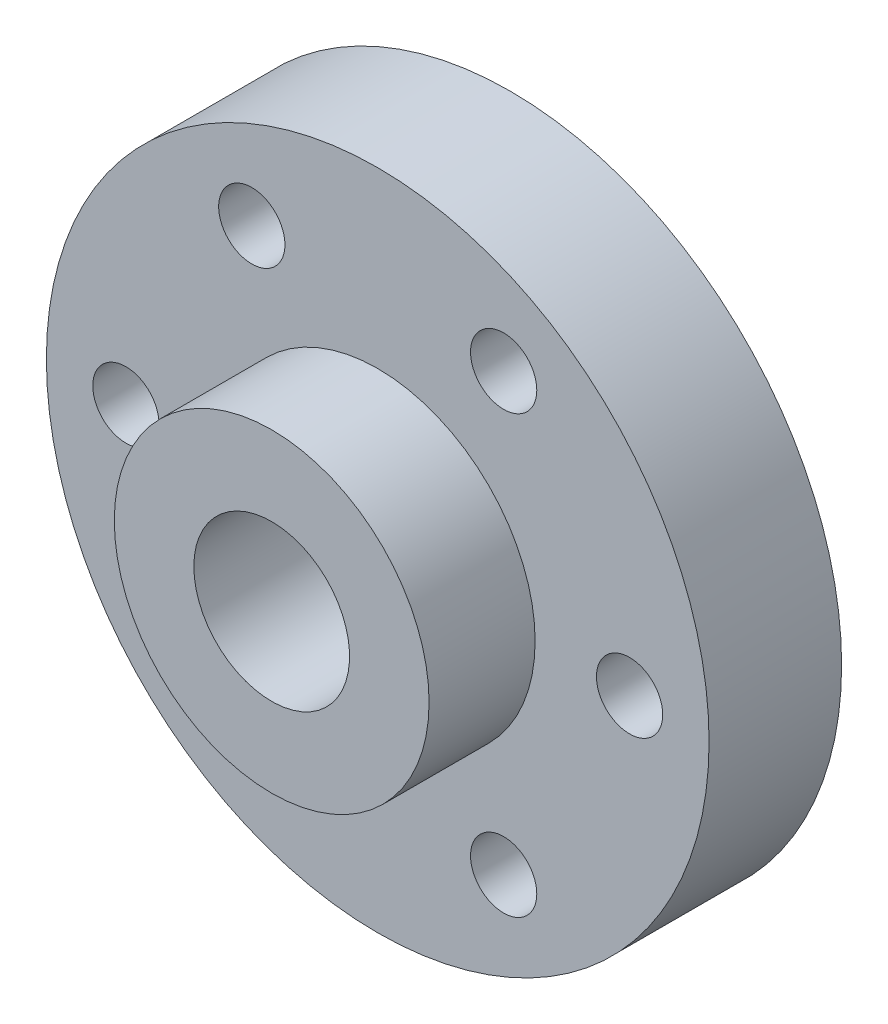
ISO-10303-21;
HEADER;
FILE_DESCRIPTION(('STEP AP214'),'2;1');
FILE_NAME('part.step','',(''),(''),'','','');
FILE_SCHEMA(('AUTOMOTIVE_DESIGN { 1 0 10303 214 1 1 1 1 }'));
ENDSEC;
DATA;
#1=APPLICATION_CONTEXT('core data for automotive mechanical design processes');
#2=APPLICATION_PROTOCOL_DEFINITION('international standard','automotive_design',2000,#1);
#3=PRODUCT_CONTEXT('',#1,'mechanical');
#4=PRODUCT('Part','Part','',(#3));
#5=PRODUCT_RELATED_PRODUCT_CATEGORY('part','',(#4));
#6=PRODUCT_DEFINITION_FORMATION('','',#4);
#7=PRODUCT_DEFINITION_CONTEXT('part definition',#1,'design');
#8=PRODUCT_DEFINITION('design','',#6,#7);
#9=PRODUCT_DEFINITION_SHAPE('','',#8);
#10=(LENGTH_UNIT() NAMED_UNIT(*) SI_UNIT(.MILLI.,.METRE.));
#11=(NAMED_UNIT(*) PLANE_ANGLE_UNIT() SI_UNIT($,.RADIAN.));
#12=(NAMED_UNIT(*) SI_UNIT($,.STERADIAN.) SOLID_ANGLE_UNIT());
#13=UNCERTAINTY_MEASURE_WITH_UNIT(LENGTH_MEASURE(1.E-05),#10,'distance_accuracy_value','');
#14=(GEOMETRIC_REPRESENTATION_CONTEXT(3) GLOBAL_UNCERTAINTY_ASSIGNED_CONTEXT((#13)) GLOBAL_UNIT_ASSIGNED_CONTEXT((#10,
#11,#12)) REPRESENTATION_CONTEXT('',''));
#15=CARTESIAN_POINT('',(0.,0.,0.));
#16=DIRECTION('',(0.,0.,1.));
#17=DIRECTION('',(1.,0.,0.));
#18=AXIS2_PLACEMENT_3D('',#15,#16,#17);
#19=CARTESIAN_POINT('',(0.,0.,5.08));
#20=DIRECTION('',(0.,0.,1.));
#21=DIRECTION('',(1.,0.,0.));
#22=AXIS2_PLACEMENT_3D('',#19,#20,#21);
#23=PLANE('',#22);
#24=CARTESIAN_POINT('',(-4.8260000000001,-8.35887719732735,5.08));
#25=DIRECTION('',(0.,0.,1.));
#26=DIRECTION('',(1.,0.,0.));
#27=AXIS2_PLACEMENT_3D('',#24,#25,#26);
#28=CIRCLE('',#27,1.27);
#29=CARTESIAN_POINT('',(-3.5560000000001,-8.35887719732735,5.08));
#30=VERTEX_POINT('',#29);
#31=EDGE_CURVE('E85',#30,#30,#28,.T.);
#32=ORIENTED_EDGE('',*,*,#31,.F.);
#33=EDGE_LOOP('',(#32));
#34=FACE_BOUND('',#33,.T.);
#35=CARTESIAN_POINT('',(4.82599999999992,-8.35887719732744,5.08));
#36=DIRECTION('',(0.,0.,1.));
#37=DIRECTION('',(1.,0.,0.));
#38=AXIS2_PLACEMENT_3D('',#35,#36,#37);
#39=CIRCLE('',#38,1.27);
#40=CARTESIAN_POINT('',(6.09599999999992,-8.35887719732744,5.08));
#41=VERTEX_POINT('',#40);
#42=EDGE_CURVE('E79',#41,#41,#39,.T.);
#43=ORIENTED_EDGE('',*,*,#42,.F.);
#44=EDGE_LOOP('',(#43));
#45=FACE_BOUND('',#44,.T.);
#46=CARTESIAN_POINT('',(9.652,0.,5.08));
#47=DIRECTION('',(0.,0.,1.));
#48=DIRECTION('',(1.,0.,0.));
#49=AXIS2_PLACEMENT_3D('',#46,#47,#48);
#50=CIRCLE('',#49,1.27);
#51=CARTESIAN_POINT('',(10.922,0.,5.08));
#52=VERTEX_POINT('',#51);
#53=EDGE_CURVE('E73',#52,#52,#50,.T.);
#54=ORIENTED_EDGE('',*,*,#53,.F.);
#55=EDGE_LOOP('',(#54));
#56=FACE_BOUND('',#55,.T.);
#57=CARTESIAN_POINT('',(4.82600000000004,8.35887719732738,5.08));
#58=DIRECTION('',(0.,0.,1.));
#59=DIRECTION('',(1.,0.,0.));
#60=AXIS2_PLACEMENT_3D('',#57,#58,#59);
#61=CIRCLE('',#60,1.27);
#62=CARTESIAN_POINT('',(6.09600000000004,8.35887719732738,5.08));
#63=VERTEX_POINT('',#62);
#64=EDGE_CURVE('E67',#63,#63,#61,.T.);
#65=ORIENTED_EDGE('',*,*,#64,.F.);
#66=EDGE_LOOP('',(#65));
#67=FACE_BOUND('',#66,.T.);
#68=CARTESIAN_POINT('',(-4.82599999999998,8.35887719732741,5.08));
#69=DIRECTION('',(0.,0.,1.));
#70=DIRECTION('',(1.,0.,0.));
#71=AXIS2_PLACEMENT_3D('',#68,#69,#70);
#72=CIRCLE('',#71,1.27);
#73=CARTESIAN_POINT('',(-3.55599999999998,8.35887719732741,5.08));
#74=VERTEX_POINT('',#73);
#75=EDGE_CURVE('E61',#74,#74,#72,.T.);
#76=ORIENTED_EDGE('',*,*,#75,.F.);
#77=EDGE_LOOP('',(#76));
#78=FACE_BOUND('',#77,.T.);
#79=CARTESIAN_POINT('',(-9.652,0.,5.08));
#80=DIRECTION('',(0.,0.,1.));
#81=DIRECTION('',(1.,0.,0.));
#82=AXIS2_PLACEMENT_3D('',#79,#80,#81);
#83=CIRCLE('',#82,1.27);
#84=CARTESIAN_POINT('',(-8.382,0.,5.08));
#85=VERTEX_POINT('',#84);
#86=EDGE_CURVE('E53',#85,#85,#83,.T.);
#87=ORIENTED_EDGE('',*,*,#86,.F.);
#88=EDGE_LOOP('',(#87));
#89=FACE_BOUND('',#88,.T.);
#90=CARTESIAN_POINT('',(0.,0.,5.08));
#91=DIRECTION('',(0.,0.,1.));
#92=DIRECTION('',(1.,0.,0.));
#93=AXIS2_PLACEMENT_3D('',#90,#91,#92);
#94=CIRCLE('',#93,12.7);
#95=CARTESIAN_POINT('',(12.7,0.,5.08));
#96=VERTEX_POINT('',#95);
#97=EDGE_CURVE('E10',#96,#96,#94,.T.);
#98=ORIENTED_EDGE('',*,*,#97,.T.);
#99=EDGE_LOOP('',(#98));
#100=FACE_BOUND('',#99,.T.);
#101=CARTESIAN_POINT('',(0.,0.,5.08));
#102=DIRECTION('',(0.,0.,1.));
#103=DIRECTION('',(1.,0.,0.));
#104=AXIS2_PLACEMENT_3D('',#101,#102,#103);
#105=CIRCLE('',#104,6.0325);
#106=CARTESIAN_POINT('',(6.0325,0.,5.08));
#107=VERTEX_POINT('',#106);
#108=EDGE_CURVE('E44',#107,#107,#105,.T.);
#109=ORIENTED_EDGE('',*,*,#108,.F.);
#110=EDGE_LOOP('',(#109));
#111=FACE_BOUND('',#110,.T.);
#112=ADVANCED_FACE('F31',(#34,#45,#56,#67,#78,#89,#100,#111),#23,.T.);
#113=CARTESIAN_POINT('',(0.,0.,5.08));
#114=DIRECTION('',(0.,0.,-1.));
#115=DIRECTION('',(-1.,0.,0.));
#116=AXIS2_PLACEMENT_3D('',#113,#114,#115);
#117=CYLINDRICAL_SURFACE('',#116,12.7);
#118=ORIENTED_EDGE('',*,*,#97,.F.);
#119=EDGE_LOOP('',(#118));
#120=FACE_BOUND('',#119,.T.);
#121=CARTESIAN_POINT('',(0.,0.,0.));
#122=DIRECTION('',(0.,0.,1.));
#123=DIRECTION('',(1.,0.,0.));
#124=AXIS2_PLACEMENT_3D('',#121,#122,#123);
#125=CIRCLE('',#124,12.7);
#126=CARTESIAN_POINT('',(12.7,0.,0.));
#127=VERTEX_POINT('',#126);
#128=EDGE_CURVE('E35',#127,#127,#125,.T.);
#129=ORIENTED_EDGE('',*,*,#128,.T.);
#130=EDGE_LOOP('',(#129));
#131=FACE_BOUND('',#130,.T.);
#132=ADVANCED_FACE('F33',(#120,#131),#117,.T.);
#133=CARTESIAN_POINT('',(0.,0.,0.));
#134=DIRECTION('',(0.,0.,1.));
#135=DIRECTION('',(1.,0.,0.));
#136=AXIS2_PLACEMENT_3D('',#133,#134,#135);
#137=PLANE('',#136);
#138=CARTESIAN_POINT('',(-4.8260000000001,-8.35887719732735,0.));
#139=DIRECTION('',(0.,0.,-1.));
#140=DIRECTION('',(-0.50000000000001,-0.866025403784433,0.));
#141=AXIS2_PLACEMENT_3D('',#138,#139,#140);
#142=CIRCLE('',#141,1.27);
#143=CARTESIAN_POINT('',(-5.46100000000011,-9.45872946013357,0.));
#144=VERTEX_POINT('',#143);
#145=EDGE_CURVE('E88',#144,#144,#142,.T.);
#146=ORIENTED_EDGE('',*,*,#145,.F.);
#147=EDGE_LOOP('',(#146));
#148=FACE_BOUND('',#147,.T.);
#149=CARTESIAN_POINT('',(4.82599999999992,-8.35887719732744,0.));
#150=DIRECTION('',(0.,0.,-1.));
#151=DIRECTION('',(0.499999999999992,-0.866025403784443,0.));
#152=AXIS2_PLACEMENT_3D('',#149,#150,#151);
#153=CIRCLE('',#152,1.27);
#154=CARTESIAN_POINT('',(5.46099999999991,-9.45872946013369,0.));
#155=VERTEX_POINT('',#154);
#156=EDGE_CURVE('E82',#155,#155,#153,.T.);
#157=ORIENTED_EDGE('',*,*,#156,.F.);
#158=EDGE_LOOP('',(#157));
#159=FACE_BOUND('',#158,.T.);
#160=CARTESIAN_POINT('',(9.652,0.,0.));
#161=DIRECTION('',(0.,0.,-1.));
#162=DIRECTION('',(1.,0.,0.));
#163=AXIS2_PLACEMENT_3D('',#160,#161,#162);
#164=CIRCLE('',#163,1.27);
#165=CARTESIAN_POINT('',(10.922,0.,0.));
#166=VERTEX_POINT('',#165);
#167=EDGE_CURVE('E76',#166,#166,#164,.T.);
#168=ORIENTED_EDGE('',*,*,#167,.F.);
#169=EDGE_LOOP('',(#168));
#170=FACE_BOUND('',#169,.T.);
#171=CARTESIAN_POINT('',(4.82600000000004,8.35887719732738,0.));
#172=DIRECTION('',(0.,0.,-1.));
#173=DIRECTION('',(0.500000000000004,0.866025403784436,0.));
#174=AXIS2_PLACEMENT_3D('',#171,#172,#173);
#175=CIRCLE('',#174,1.27);
#176=CARTESIAN_POINT('',(5.46100000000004,9.45872946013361,0.));
#177=VERTEX_POINT('',#176);
#178=EDGE_CURVE('E70',#177,#177,#175,.T.);
#179=ORIENTED_EDGE('',*,*,#178,.F.);
#180=EDGE_LOOP('',(#179));
#181=FACE_BOUND('',#180,.T.);
#182=CARTESIAN_POINT('',(-4.82599999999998,8.35887719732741,0.));
#183=DIRECTION('',(0.,0.,-1.));
#184=DIRECTION('',(-0.499999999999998,0.86602540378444,0.));
#185=AXIS2_PLACEMENT_3D('',#182,#183,#184);
#186=CIRCLE('',#185,1.27);
#187=CARTESIAN_POINT('',(-5.46099999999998,9.45872946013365,0.));
#188=VERTEX_POINT('',#187);
#189=EDGE_CURVE('E64',#188,#188,#186,.T.);
#190=ORIENTED_EDGE('',*,*,#189,.F.);
#191=EDGE_LOOP('',(#190));
#192=FACE_BOUND('',#191,.T.);
#193=CARTESIAN_POINT('',(-9.652,0.,0.));
#194=DIRECTION('',(0.,0.,-1.));
#195=DIRECTION('',(-1.,0.,0.));
#196=AXIS2_PLACEMENT_3D('',#193,#194,#195);
#197=CIRCLE('',#196,1.27);
#198=CARTESIAN_POINT('',(-10.922,0.,0.));
#199=VERTEX_POINT('',#198);
#200=EDGE_CURVE('E58',#199,#199,#197,.T.);
#201=ORIENTED_EDGE('',*,*,#200,.F.);
#202=EDGE_LOOP('',(#201));
#203=FACE_BOUND('',#202,.T.);
#204=CARTESIAN_POINT('',(0.,0.,0.));
#205=DIRECTION('',(0.,0.,-1.));
#206=DIRECTION('',(-1.,0.,0.));
#207=AXIS2_PLACEMENT_3D('',#204,#205,#206);
#208=CIRCLE('',#207,2.9845);
#209=CARTESIAN_POINT('',(-2.9845,0.,0.));
#210=VERTEX_POINT('',#209);
#211=EDGE_CURVE('E50',#210,#210,#208,.T.);
#212=ORIENTED_EDGE('',*,*,#211,.F.);
#213=EDGE_LOOP('',(#212));
#214=FACE_BOUND('',#213,.T.);
#215=ORIENTED_EDGE('',*,*,#128,.F.);
#216=EDGE_LOOP('',(#215));
#217=FACE_BOUND('',#216,.T.);
#218=ADVANCED_FACE('F94',(#148,#159,#170,#181,#192,#203,#214,#217),#137,.F.);
#219=CARTESIAN_POINT('',(0.,0.,9.144));
#220=DIRECTION('',(0.,0.,-1.));
#221=DIRECTION('',(-1.,0.,0.));
#222=AXIS2_PLACEMENT_3D('',#219,#220,#221);
#223=CYLINDRICAL_SURFACE('',#222,6.0325);
#224=CARTESIAN_POINT('',(0.,0.,9.144));
#225=DIRECTION('',(0.,0.,1.));
#226=DIRECTION('',(1.,0.,0.));
#227=AXIS2_PLACEMENT_3D('',#224,#225,#226);
#228=CIRCLE('',#227,6.0325);
#229=CARTESIAN_POINT('',(6.0325,0.,9.144));
#230=VERTEX_POINT('',#229);
#231=EDGE_CURVE('E42',#230,#230,#228,.T.);
#232=ORIENTED_EDGE('',*,*,#231,.F.);
#233=EDGE_LOOP('',(#232));
#234=FACE_BOUND('',#233,.T.);
#235=ORIENTED_EDGE('',*,*,#108,.T.);
#236=EDGE_LOOP('',(#235));
#237=FACE_BOUND('',#236,.T.);
#238=ADVANCED_FACE('F97',(#234,#237),#223,.T.);
#239=CARTESIAN_POINT('',(0.,0.,9.144));
#240=DIRECTION('',(0.,0.,1.));
#241=DIRECTION('',(1.,0.,0.));
#242=AXIS2_PLACEMENT_3D('',#239,#240,#241);
#243=PLANE('',#242);
#244=CARTESIAN_POINT('',(0.,0.,9.144));
#245=DIRECTION('',(0.,0.,-1.));
#246=DIRECTION('',(-1.,0.,0.));
#247=AXIS2_PLACEMENT_3D('',#244,#245,#246);
#248=CIRCLE('',#247,2.9845);
#249=CARTESIAN_POINT('',(-2.9845,0.,9.144));
#250=VERTEX_POINT('',#249);
#251=EDGE_CURVE('E47',#250,#250,#248,.T.);
#252=ORIENTED_EDGE('',*,*,#251,.T.);
#253=EDGE_LOOP('',(#252));
#254=FACE_BOUND('',#253,.T.);
#255=ORIENTED_EDGE('',*,*,#231,.T.);
#256=EDGE_LOOP('',(#255));
#257=FACE_BOUND('',#256,.T.);
#258=ADVANCED_FACE('F126',(#254,#257),#243,.T.);
#259=CARTESIAN_POINT('',(0.,0.,9.144));
#260=DIRECTION('',(0.,0.,-1.));
#261=DIRECTION('',(-1.,0.,0.));
#262=AXIS2_PLACEMENT_3D('',#259,#260,#261);
#263=CYLINDRICAL_SURFACE('',#262,2.9845);
#264=ORIENTED_EDGE('',*,*,#251,.F.);
#265=EDGE_LOOP('',(#264));
#266=FACE_BOUND('',#265,.T.);
#267=ORIENTED_EDGE('',*,*,#211,.T.);
#268=EDGE_LOOP('',(#267));
#269=FACE_BOUND('',#268,.T.);
#270=ADVANCED_FACE('F130',(#266,#269),#263,.F.);
#271=CARTESIAN_POINT('',(-9.652,0.,9.144));
#272=DIRECTION('',(0.,0.,-1.));
#273=DIRECTION('',(-1.,0.,0.));
#274=AXIS2_PLACEMENT_3D('',#271,#272,#273);
#275=CYLINDRICAL_SURFACE('',#274,1.27);
#276=ORIENTED_EDGE('',*,*,#86,.T.);
#277=EDGE_LOOP('',(#276));
#278=FACE_BOUND('',#277,.T.);
#279=ORIENTED_EDGE('',*,*,#200,.T.);
#280=EDGE_LOOP('',(#279));
#281=FACE_BOUND('',#280,.T.);
#282=ADVANCED_FACE('F134',(#278,#281),#275,.F.);
#283=CARTESIAN_POINT('',(-4.82599999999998,8.35887719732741,9.144));
#284=DIRECTION('',(0.,0.,-1.));
#285=DIRECTION('',(-1.,0.,0.));
#286=AXIS2_PLACEMENT_3D('',#283,#284,#285);
#287=CYLINDRICAL_SURFACE('',#286,1.27);
#288=ORIENTED_EDGE('',*,*,#75,.T.);
#289=EDGE_LOOP('',(#288));
#290=FACE_BOUND('',#289,.T.);
#291=ORIENTED_EDGE('',*,*,#189,.T.);
#292=EDGE_LOOP('',(#291));
#293=FACE_BOUND('',#292,.T.);
#294=ADVANCED_FACE('F138',(#290,#293),#287,.F.);
#295=CARTESIAN_POINT('',(4.82600000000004,8.35887719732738,9.144));
#296=DIRECTION('',(0.,0.,-1.));
#297=DIRECTION('',(-1.,0.,0.));
#298=AXIS2_PLACEMENT_3D('',#295,#296,#297);
#299=CYLINDRICAL_SURFACE('',#298,1.27);
#300=ORIENTED_EDGE('',*,*,#64,.T.);
#301=EDGE_LOOP('',(#300));
#302=FACE_BOUND('',#301,.T.);
#303=ORIENTED_EDGE('',*,*,#178,.T.);
#304=EDGE_LOOP('',(#303));
#305=FACE_BOUND('',#304,.T.);
#306=ADVANCED_FACE('F142',(#302,#305),#299,.F.);
#307=CARTESIAN_POINT('',(9.652,0.,9.144));
#308=DIRECTION('',(0.,0.,-1.));
#309=DIRECTION('',(-1.,0.,0.));
#310=AXIS2_PLACEMENT_3D('',#307,#308,#309);
#311=CYLINDRICAL_SURFACE('',#310,1.27);
#312=ORIENTED_EDGE('',*,*,#53,.T.);
#313=EDGE_LOOP('',(#312));
#314=FACE_BOUND('',#313,.T.);
#315=ORIENTED_EDGE('',*,*,#167,.T.);
#316=EDGE_LOOP('',(#315));
#317=FACE_BOUND('',#316,.T.);
#318=ADVANCED_FACE('F146',(#314,#317),#311,.F.);
#319=CARTESIAN_POINT('',(4.82599999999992,-8.35887719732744,9.144));
#320=DIRECTION('',(0.,0.,-1.));
#321=DIRECTION('',(-1.,0.,0.));
#322=AXIS2_PLACEMENT_3D('',#319,#320,#321);
#323=CYLINDRICAL_SURFACE('',#322,1.27);
#324=ORIENTED_EDGE('',*,*,#42,.T.);
#325=EDGE_LOOP('',(#324));
#326=FACE_BOUND('',#325,.T.);
#327=ORIENTED_EDGE('',*,*,#156,.T.);
#328=EDGE_LOOP('',(#327));
#329=FACE_BOUND('',#328,.T.);
#330=ADVANCED_FACE('F150',(#326,#329),#323,.F.);
#331=CARTESIAN_POINT('',(-4.8260000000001,-8.35887719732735,9.144));
#332=DIRECTION('',(0.,0.,-1.));
#333=DIRECTION('',(-1.,0.,0.));
#334=AXIS2_PLACEMENT_3D('',#331,#332,#333);
#335=CYLINDRICAL_SURFACE('',#334,1.27);
#336=ORIENTED_EDGE('',*,*,#31,.T.);
#337=EDGE_LOOP('',(#336));
#338=FACE_BOUND('',#337,.T.);
#339=ORIENTED_EDGE('',*,*,#145,.T.);
#340=EDGE_LOOP('',(#339));
#341=FACE_BOUND('',#340,.T.);
#342=ADVANCED_FACE('F92',(#338,#341),#335,.F.);
#343=CLOSED_SHELL('',(#112,#132,#218,#238,#258,#270,#282,#294,#306,#318,#330,#342));
#344=MANIFOLD_SOLID_BREP('B2',#343);
#345=ADVANCED_BREP_SHAPE_REPRESENTATION('',(#18,#344),#14);
#346=SHAPE_DEFINITION_REPRESENTATION(#9,#345);
ENDSEC;
END-ISO-10303-21;
